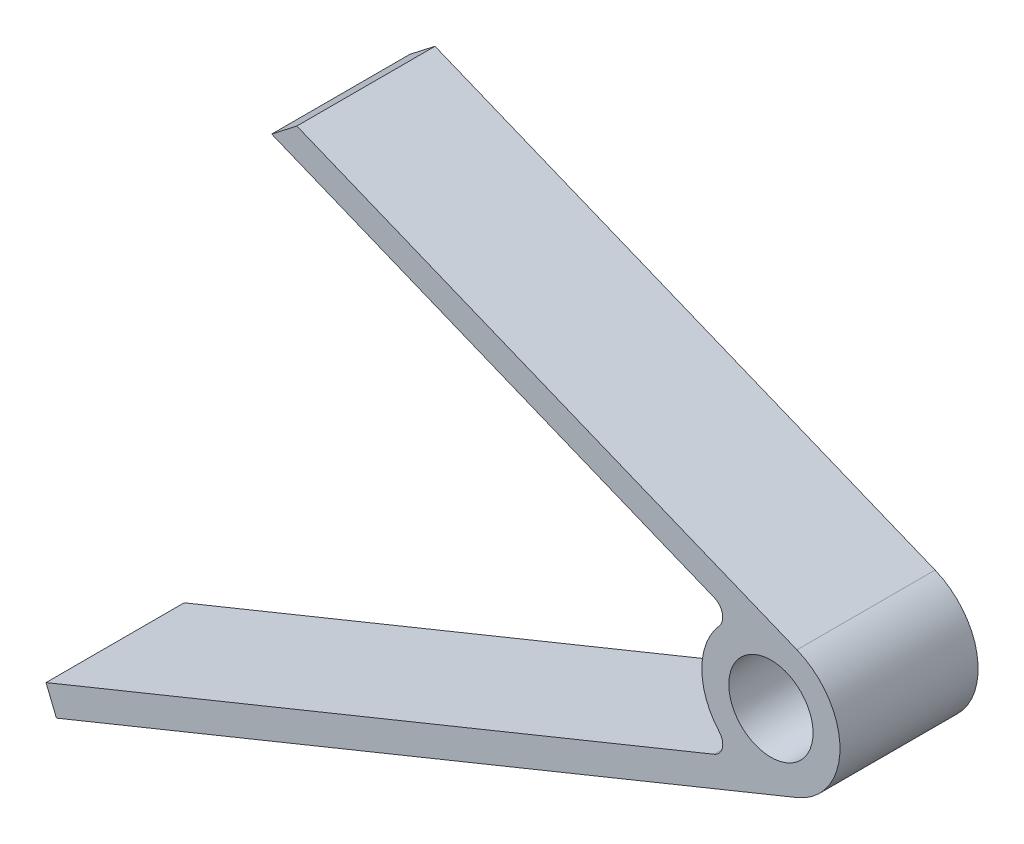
from build123d import *

# Parameters (mm, degrees)
SKETCH_1_R      = 3.05
EXTRUDE_1_DEPTH = 10


with BuildPart() as part:
    # Sketch 1 → Extrude 1 (new body)
    with BuildSketch(Plane.XY):
        with BuildLine():
            Line((-34.314084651, 19.36680163), (1.885163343, 4.630999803))
            ThreePointArc((1.885163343, 4.630999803), (5, 0), (1.885163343, -4.630999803))
            Line((1.885163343, -4.630999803), (-51.718119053, -26.451545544))
            Line((-51.718119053, -26.451545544), (-52.47218439, -24.599145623))
            Line((-52.47218439, -24.599145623), (-4.108280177, -4.911418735))
            ThreePointArc((-4.108280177, -4.911418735), (-3.511393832, -4.212114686), (-3.737760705, -3.321015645))
            ThreePointArc((-3.737760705, -3.321015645), (-5, 0), (-3.737760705, 3.321015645))
            ThreePointArc((-3.737760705, 3.321015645), (-3.511393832, 4.212114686), (-4.108280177, 4.911418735))
            Line((-4.108280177, 4.911418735), (-36.137633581, 17.949761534))
            Line((-36.137633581, 17.949761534), (-34.314084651, 19.36680163))
        make_face()
        Circle(SKETCH_1_R, mode=Mode.SUBTRACT)
    extrude(amount=EXTRUDE_1_DEPTH)


solid = part.part
